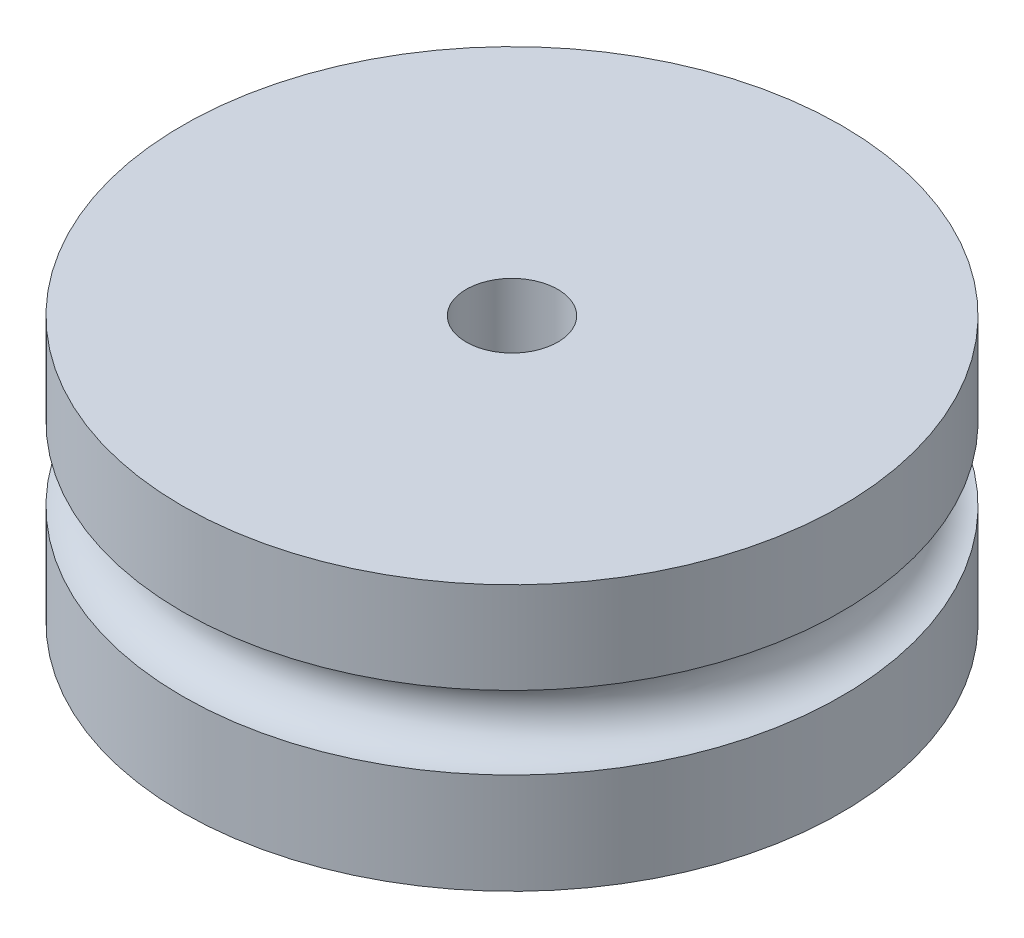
from build123d import *

# Parameters (mm, degrees)
SKETCH1_R             = 18
BOSS_EXTRUDE1_DEPTH   = 7.25
SKETCH2_R             = 2
F_5_0MM_DOWEL_HOLE2_D = 5


with BuildPart() as part:
    # Sketch1 → Boss-Extrude1 (new, symmetric)
    with BuildSketch(Plane(origin=(0, 0, 0), x_dir=(1, 0, 0), z_dir=(0, 1, 0))):
        with Locations(Location((0, 0, 0), (0, 0, 90))):
            Circle(SKETCH1_R)
    extrude(amount=BOSS_EXTRUDE1_DEPTH, both=True)

    # Sketch2 → Cut-Revolve1 (revolve, cut)
    with BuildSketch(Plane.XY, mode=Mode.PRIVATE) as cut_revolve1_sk:
        with Locations((-18, 0.25)):
            Circle(SKETCH2_R)
    revolve(cut_revolve1_sk.sketch.rotate(Axis((0, 7.25, 0), (0, -1, 0)), 90), axis=Axis((0, 7.25, 0), (0, -1, 0)), mode=Mode.SUBTRACT)

    # 5.0mm Dowel Hole2 (through all)
    with Locations(Plane(origin=(0, 7.25, 0), x_dir=(1, 0, 0), z_dir=(0, 1, 0))):
        with Locations((0, 0)):
            Hole(F_5_0MM_DOWEL_HOLE2_D / 2)


solid = part.part
